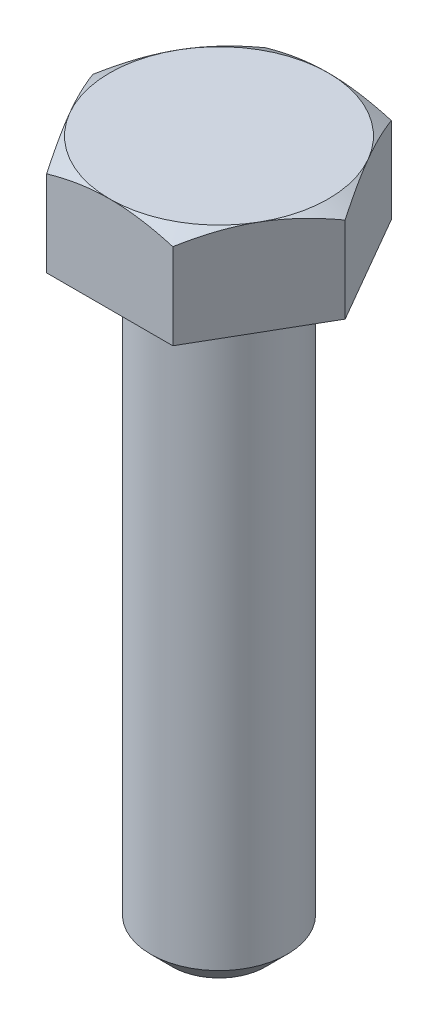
ISO-10303-21;
HEADER;
FILE_DESCRIPTION(('STEP AP214'),'2;1');
FILE_NAME('part.step','',(''),(''),'','','');
FILE_SCHEMA(('AUTOMOTIVE_DESIGN { 1 0 10303 214 1 1 1 1 }'));
ENDSEC;
DATA;
#1=APPLICATION_CONTEXT('core data for automotive mechanical design processes');
#2=APPLICATION_PROTOCOL_DEFINITION('international standard','automotive_design',2000,#1);
#3=PRODUCT_CONTEXT('',#1,'mechanical');
#4=PRODUCT('Part','Part','',(#3));
#5=PRODUCT_RELATED_PRODUCT_CATEGORY('part','',(#4));
#6=PRODUCT_DEFINITION_FORMATION('','',#4);
#7=PRODUCT_DEFINITION_CONTEXT('part definition',#1,'design');
#8=PRODUCT_DEFINITION('design','',#6,#7);
#9=PRODUCT_DEFINITION_SHAPE('','',#8);
#10=(LENGTH_UNIT() NAMED_UNIT(*) SI_UNIT(.MILLI.,.METRE.));
#11=(NAMED_UNIT(*) PLANE_ANGLE_UNIT() SI_UNIT($,.RADIAN.));
#12=(NAMED_UNIT(*) SI_UNIT($,.STERADIAN.) SOLID_ANGLE_UNIT());
#13=UNCERTAINTY_MEASURE_WITH_UNIT(LENGTH_MEASURE(1.E-05),#10,'distance_accuracy_value','');
#14=(GEOMETRIC_REPRESENTATION_CONTEXT(3) GLOBAL_UNCERTAINTY_ASSIGNED_CONTEXT((#13)) GLOBAL_UNIT_ASSIGNED_CONTEXT((#10,
#11,#12)) REPRESENTATION_CONTEXT('',''));
#15=CARTESIAN_POINT('',(0.,0.,0.));
#16=DIRECTION('',(0.,0.,1.));
#17=DIRECTION('',(1.,0.,0.));
#18=AXIS2_PLACEMENT_3D('',#15,#16,#17);
#19=CARTESIAN_POINT('',(0.,3.5,0.));
#20=DIRECTION('',(0.,-1.,0.));
#21=DIRECTION('',(1.,0.,0.));
#22=AXIS2_PLACEMENT_3D('',#19,#20,#21);
#23=PLANE('',#22);
#24=CARTESIAN_POINT('',(0.,3.50000000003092,0.));
#25=DIRECTION('',(0.,-1.,0.));
#26=DIRECTION('',(0.,0.,-1.));
#27=AXIS2_PLACEMENT_3D('',#24,#25,#26);
#28=CIRCLE('',#27,3.99999999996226);
#29=CARTESIAN_POINT('',(3.4641016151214,3.50000000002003,1.99999999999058));
#30=VERTEX_POINT('',#29);
#31=CARTESIAN_POINT('',(0.,3.50000000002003,3.99999999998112));
#32=VERTEX_POINT('',#31);
#33=EDGE_CURVE('E89',#30,#32,#28,.T.);
#34=ORIENTED_EDGE('',*,*,#33,.F.);
#35=CARTESIAN_POINT('',(0.,3.50000000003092,0.));
#36=DIRECTION('',(0.,-1.,0.));
#37=DIRECTION('',(0.,0.,-1.));
#38=AXIS2_PLACEMENT_3D('',#35,#36,#37);
#39=CIRCLE('',#38,3.99999999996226);
#40=CARTESIAN_POINT('',(3.4641016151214,3.50000000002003,-1.99999999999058));
#41=VERTEX_POINT('',#40);
#42=EDGE_CURVE('E87',#41,#30,#39,.T.);
#43=ORIENTED_EDGE('',*,*,#42,.F.);
#44=CARTESIAN_POINT('',(0.,3.50000000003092,0.));
#45=DIRECTION('',(0.,-1.,0.));
#46=DIRECTION('',(0.,0.,-1.));
#47=AXIS2_PLACEMENT_3D('',#44,#45,#46);
#48=CIRCLE('',#47,3.99999999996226);
#49=CARTESIAN_POINT('',(0.,3.50000000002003,-3.99999999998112));
#50=VERTEX_POINT('',#49);
#51=EDGE_CURVE('E20',#50,#41,#48,.T.);
#52=ORIENTED_EDGE('',*,*,#51,.F.);
#53=CARTESIAN_POINT('',(0.,3.50000000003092,0.));
#54=DIRECTION('',(0.,-1.,0.));
#55=DIRECTION('',(0.,0.,-1.));
#56=AXIS2_PLACEMENT_3D('',#53,#54,#55);
#57=CIRCLE('',#56,3.99999999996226);
#58=CARTESIAN_POINT('',(-3.4641016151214,3.50000000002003,-1.99999999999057));
#59=VERTEX_POINT('',#58);
#60=EDGE_CURVE('E104',#59,#50,#57,.T.);
#61=ORIENTED_EDGE('',*,*,#60,.F.);
#62=CARTESIAN_POINT('',(0.,3.50000000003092,0.));
#63=DIRECTION('',(0.,-1.,0.));
#64=DIRECTION('',(0.,0.,-1.));
#65=AXIS2_PLACEMENT_3D('',#62,#63,#64);
#66=CIRCLE('',#65,3.99999999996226);
#67=CARTESIAN_POINT('',(-3.4641016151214,3.50000000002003,1.99999999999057));
#68=VERTEX_POINT('',#67);
#69=EDGE_CURVE('E323',#68,#59,#66,.T.);
#70=ORIENTED_EDGE('',*,*,#69,.F.);
#71=CARTESIAN_POINT('',(0.,3.50000000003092,0.));
#72=DIRECTION('',(0.,-1.,0.));
#73=DIRECTION('',(0.,0.,-1.));
#74=AXIS2_PLACEMENT_3D('',#71,#72,#73);
#75=CIRCLE('',#74,3.99999999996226);
#76=EDGE_CURVE('E93',#32,#68,#75,.T.);
#77=ORIENTED_EDGE('',*,*,#76,.F.);
#78=EDGE_LOOP('',(#34,#43,#52,#61,#70,#77));
#79=FACE_BOUND('',#78,.T.);
#80=ADVANCED_FACE('F16',(#79),#23,.F.);
#81=CARTESIAN_POINT('',(0.,3.14059081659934,0.));
#82=DIRECTION('',(0.,-1.,0.));
#83=DIRECTION('',(0.,0.,-1.));
#84=AXIS2_PLACEMENT_3D('',#81,#82,#83);
#85=CONICAL_SURFACE('',#84,4.62251496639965,1.04719755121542);
#86=ORIENTED_EDGE('',*,*,#51,.T.);
#87=CARTESIAN_POINT('',(2.30940107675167,3.14273441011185,-4.00000000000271));
#88=CARTESIAN_POINT('',(2.4033932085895,3.19701440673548,-3.8372008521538));
#89=CARTESIAN_POINT('',(2.49813806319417,3.24674436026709,-3.67309795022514));
#90=CARTESIAN_POINT('',(2.68846293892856,3.33444223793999,-3.34344559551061));
#91=CARTESIAN_POINT('',(2.78403632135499,3.37246832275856,-3.17790764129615));
#92=CARTESIAN_POINT('',(2.92829837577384,3.41915789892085,-2.9280384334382));
#93=CARTESIAN_POINT('',(2.97656796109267,3.43300183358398,-2.84443305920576));
#94=CARTESIAN_POINT('',(3.07333821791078,3.45696597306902,-2.67682205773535));
#95=CARTESIAN_POINT('',(3.12183888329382,3.46708627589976,-2.59281644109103));
#96=CARTESIAN_POINT('',(3.21925069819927,3.48342533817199,-2.42409422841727));
#97=CARTESIAN_POINT('',(3.26816268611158,3.4896242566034,-2.33937618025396));
#98=CARTESIAN_POINT('',(3.36608285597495,3.49792016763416,-2.16977347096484));
#99=CARTESIAN_POINT('',(3.41509105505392,3.50001634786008,-2.08488878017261));
#100=CARTESIAN_POINT('',(3.46410161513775,3.50000000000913,-2.00000000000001));
#101=B_SPLINE_CURVE_WITH_KNOTS('',3,(#87,#88,#89,#90,#91,#92,#93,#94,#95,#96,#97,#98,#99,#100),
.UNSPECIFIED.,.F.,.F.,(4,2,2,2,2,2,4),(0.,0.587229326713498,1.17149154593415,1.4640059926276,
1.75651273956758,2.05048788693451,2.3445212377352),.UNSPECIFIED.);
#102=CARTESIAN_POINT('',(2.30940107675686,3.14273441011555,-4.00000000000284));
#103=VERTEX_POINT('',#102);
#104=EDGE_CURVE('E99',#103,#41,#101,.T.);
#105=ORIENTED_EDGE('',*,*,#104,.F.);
#106=CARTESIAN_POINT('',(0.,3.50000000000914,-3.99999999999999));
#107=CARTESIAN_POINT('',(0.0980211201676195,3.50001634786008,-3.99999999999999));
#108=CARTESIAN_POINT('',(0.196037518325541,3.49792016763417,-3.99999999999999));
#109=CARTESIAN_POINT('',(0.39187785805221,3.48962425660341,-3.99999999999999));
#110=CARTESIAN_POINT('',(0.489701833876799,3.48342533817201,-3.99999999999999));
#111=CARTESIAN_POINT('',(0.684525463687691,3.46708627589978,-3.99999999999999));
#112=CARTESIAN_POINT('',(0.781526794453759,3.45696597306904,-3.99999999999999));
#113=CARTESIAN_POINT('',(0.975067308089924,3.43300183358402,-3.99999999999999));
#114=CARTESIAN_POINT('',(1.07160647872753,3.41915789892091,-3.99999999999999));
#115=CARTESIAN_POINT('',(1.36013058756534,3.37246832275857,-3.99999999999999));
#116=CARTESIAN_POINT('',(1.55127735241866,3.33444223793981,-3.99999999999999));
#117=CARTESIAN_POINT('',(1.93192710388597,3.24674436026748,-3.99999999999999));
#118=CARTESIAN_POINT('',(2.12141681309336,3.19701440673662,-3.99999999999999));
#119=CARTESIAN_POINT('',(2.30940107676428,3.14273441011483,-3.99999999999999));
#120=B_SPLINE_CURVE_WITH_KNOTS('',3,(#106,#107,#108,#109,#110,#111,#112,#113,#114,#115,#116,
#117,#118,#119),.UNSPECIFIED.,.F.,.F.,(4,2,2,2,2,2,4),(0.,0.294033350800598,0.588008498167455,
0.880515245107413,1.17302969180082,1.75729191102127,2.34452123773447),.UNSPECIFIED.);
#121=EDGE_CURVE('E102',#50,#103,#120,.T.);
#122=ORIENTED_EDGE('',*,*,#121,.F.);
#123=EDGE_LOOP('',(#86,#105,#122));
#124=FACE_BOUND('',#123,.T.);
#125=ADVANCED_FACE('F97',(#124),#85,.T.);
#126=CARTESIAN_POINT('',(0.,3.14059081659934,0.));
#127=DIRECTION('',(0.,-1.,0.));
#128=DIRECTION('',(0.,0.,-1.));
#129=AXIS2_PLACEMENT_3D('',#126,#127,#128);
#130=CONICAL_SURFACE('',#129,4.62251496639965,1.04719755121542);
#131=ORIENTED_EDGE('',*,*,#60,.T.);
#132=CARTESIAN_POINT('',(-2.30940107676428,3.14273441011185,-3.99999999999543));
#133=CARTESIAN_POINT('',(-2.12141681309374,3.19701440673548,-3.9999999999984));
#134=CARTESIAN_POINT('',(-1.93192710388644,3.24674436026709,-3.99999999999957));
#135=CARTESIAN_POINT('',(-1.55127735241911,3.33444223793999,-4.0000000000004));
#136=CARTESIAN_POINT('',(-1.36013058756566,3.37246832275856,-4.00000000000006));
#137=CARTESIAN_POINT('',(-1.07160647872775,3.41915789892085,-3.99999999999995));
#138=CARTESIAN_POINT('',(-0.975067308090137,3.43300183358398,-3.99999999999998));
#139=CARTESIAN_POINT('',(-0.781526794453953,3.45696597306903,-4.));
#140=CARTESIAN_POINT('',(-0.684525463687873,3.46708627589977,-3.99999999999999));
#141=CARTESIAN_POINT('',(-0.489701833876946,3.483425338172,-3.99999999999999));
#142=CARTESIAN_POINT('',(-0.391877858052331,3.4896242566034,-3.99999999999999));
#143=CARTESIAN_POINT('',(-0.196037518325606,3.49792016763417,-3.99999999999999));
#144=CARTESIAN_POINT('',(-0.098021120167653,3.50001634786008,-3.99999999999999));
#145=CARTESIAN_POINT('',(0.,3.50000000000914,-3.99999999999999));
#146=B_SPLINE_CURVE_WITH_KNOTS('',3,(#132,#133,#134,#135,#136,#137,#138,#139,#140,#141,#142,
#143,#144,#145),.UNSPECIFIED.,.F.,.F.,(4,2,2,2,2,2,4),(0.,0.587229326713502,1.17149154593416,
1.46400599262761,1.75651273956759,2.05048788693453,2.34452123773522),.UNSPECIFIED.);
#147=CARTESIAN_POINT('',(-2.30940107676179,3.14273441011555,-3.99999999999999));
#148=VERTEX_POINT('',#147);
#149=EDGE_CURVE('E113',#148,#50,#146,.T.);
#150=ORIENTED_EDGE('',*,*,#149,.F.);
#151=CARTESIAN_POINT('',(-3.46410161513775,3.50000000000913,-2.00000000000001));
#152=CARTESIAN_POINT('',(-3.41509105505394,3.50001634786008,-2.08488878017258));
#153=CARTESIAN_POINT('',(-3.36608285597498,3.49792016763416,-2.16977347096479));
#154=CARTESIAN_POINT('',(-3.26816268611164,3.4896242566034,-2.33937618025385));
#155=CARTESIAN_POINT('',(-3.21925069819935,3.483425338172,-2.42409422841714));
#156=CARTESIAN_POINT('',(-3.1218388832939,3.46708627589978,-2.59281644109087));
#157=CARTESIAN_POINT('',(-3.07333821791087,3.45696597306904,-2.67682205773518));
#158=CARTESIAN_POINT('',(-2.97656796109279,3.43300183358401,-2.84443305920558));
#159=CARTESIAN_POINT('',(-2.92829837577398,3.41915789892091,-2.92803843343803));
#160=CARTESIAN_POINT('',(-2.78403632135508,3.37246832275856,-3.17790764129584));
#161=CARTESIAN_POINT('',(-2.68846293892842,3.33444223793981,-3.34344559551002));
#162=CARTESIAN_POINT('',(-2.49813806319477,3.24674436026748,-3.67309795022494));
#163=CARTESIAN_POINT('',(-2.40339320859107,3.19701440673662,-3.83720085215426));
#164=CARTESIAN_POINT('',(-2.30940107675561,3.14273441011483,-4.00000000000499));
#165=B_SPLINE_CURVE_WITH_KNOTS('',3,(#151,#152,#153,#154,#155,#156,#157,#158,#159,#160,#161,
#162,#163,#164),.UNSPECIFIED.,.F.,.F.,(4,2,2,2,2,2,4),(0.,0.294033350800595,0.58800849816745,
0.880515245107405,1.17302969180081,1.75729191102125,2.34452123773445),.UNSPECIFIED.);
#166=EDGE_CURVE('E169',#59,#148,#165,.T.);
#167=ORIENTED_EDGE('',*,*,#166,.F.);
#168=EDGE_LOOP('',(#131,#150,#167));
#169=FACE_BOUND('',#168,.T.);
#170=ADVANCED_FACE('F137',(#169),#130,.T.);
#171=CARTESIAN_POINT('',(0.,3.14059081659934,0.));
#172=DIRECTION('',(0.,-1.,0.));
#173=DIRECTION('',(0.,0.,-1.));
#174=AXIS2_PLACEMENT_3D('',#171,#172,#173);
#175=CONICAL_SURFACE('',#174,4.62251496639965,1.04719755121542);
#176=ORIENTED_EDGE('',*,*,#69,.T.);
#177=CARTESIAN_POINT('',(-4.61880215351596,3.14273441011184,7.2818296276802E-12));
#178=CARTESIAN_POINT('',(-4.52481002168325,3.19701440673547,-0.162799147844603));
#179=CARTESIAN_POINT('',(-4.43006516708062,3.24674436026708,-0.326902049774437));
#180=CARTESIAN_POINT('',(-4.23974029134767,3.33444223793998,-0.656554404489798));
#181=CARTESIAN_POINT('',(-4.14416690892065,3.37246832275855,-0.822092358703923));
#182=CARTESIAN_POINT('',(-3.9999048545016,3.41915789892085,-1.07196156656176));
#183=CARTESIAN_POINT('',(-3.95163526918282,3.43300183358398,-1.15556694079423));
#184=CARTESIAN_POINT('',(-3.85486501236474,3.45696597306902,-1.32317794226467));
#185=CARTESIAN_POINT('',(-3.80636434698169,3.46708627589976,-1.40718355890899));
#186=CARTESIAN_POINT('',(-3.70895253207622,3.48342533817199,-1.57590577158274));
#187=CARTESIAN_POINT('',(-3.66004054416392,3.4896242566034,-1.66062381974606));
#188=CARTESIAN_POINT('',(-3.56212037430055,3.49792016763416,-1.83022652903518));
#189=CARTESIAN_POINT('',(-3.51311217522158,3.50001634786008,-1.91511121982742));
#190=CARTESIAN_POINT('',(-3.46410161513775,3.50000000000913,-2.00000000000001));
#191=B_SPLINE_CURVE_WITH_KNOTS('',3,(#177,#178,#179,#180,#181,#182,#183,#184,#185,#186,#187,
#188,#189,#190),.UNSPECIFIED.,.F.,.F.,(4,2,2,2,2,2,4),(0.,0.587229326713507,1.17149154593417,
1.46400599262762,1.75651273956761,2.05048788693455,2.34452123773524),.UNSPECIFIED.);
#192=CARTESIAN_POINT('',(-4.61880215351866,3.14273441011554,2.84537209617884E-12));
#193=VERTEX_POINT('',#192);
#194=EDGE_CURVE('E146',#193,#59,#191,.T.);
#195=ORIENTED_EDGE('',*,*,#194,.F.);
#196=CARTESIAN_POINT('',(-3.46410161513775,3.50000000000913,2.00000000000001));
#197=CARTESIAN_POINT('',(-3.51311217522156,3.50001634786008,1.91511121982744));
#198=CARTESIAN_POINT('',(-3.56212037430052,3.49792016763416,1.83022652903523));
#199=CARTESIAN_POINT('',(-3.66004054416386,3.4896242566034,1.66062381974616));
#200=CARTESIAN_POINT('',(-3.70895253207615,3.483425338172,1.57590577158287));
#201=CARTESIAN_POINT('',(-3.8063643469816,3.46708627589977,1.40718355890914));
#202=CARTESIAN_POINT('',(-3.85486501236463,3.45696597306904,1.32317794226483));
#203=CARTESIAN_POINT('',(-3.95163526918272,3.43300183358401,1.15556694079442));
#204=CARTESIAN_POINT('',(-3.99990485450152,3.4191578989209,1.07196156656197));
#205=CARTESIAN_POINT('',(-4.14416690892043,3.37246832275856,0.822092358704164));
#206=CARTESIAN_POINT('',(-4.23974029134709,3.3344422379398,0.656554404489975));
#207=CARTESIAN_POINT('',(-4.43006516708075,3.24674436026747,0.326902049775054));
#208=CARTESIAN_POINT('',(-4.52481002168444,3.19701440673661,0.162799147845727));
#209=CARTESIAN_POINT('',(-4.6188021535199,3.14273441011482,-5.00231021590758E-12));
#210=B_SPLINE_CURVE_WITH_KNOTS('',3,(#196,#197,#198,#199,#200,#201,#202,#203,#204,#205,#206,
#207,#208,#209),.UNSPECIFIED.,.F.,.F.,(4,2,2,2,2,2,4),(0.,0.294033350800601,0.58800849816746,
0.880515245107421,1.17302969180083,1.75729191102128,2.34452123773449),.UNSPECIFIED.);
#211=EDGE_CURVE('E183',#68,#193,#210,.T.);
#212=ORIENTED_EDGE('',*,*,#211,.F.);
#213=EDGE_LOOP('',(#176,#195,#212));
#214=FACE_BOUND('',#213,.T.);
#215=ADVANCED_FACE('F191',(#214),#175,.T.);
#216=CARTESIAN_POINT('',(0.,3.14059081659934,0.));
#217=DIRECTION('',(0.,-1.,0.));
#218=DIRECTION('',(0.,0.,-1.));
#219=AXIS2_PLACEMENT_3D('',#216,#217,#218);
#220=CONICAL_SURFACE('',#219,4.62251496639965,1.04719755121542);
#221=ORIENTED_EDGE('',*,*,#76,.T.);
#222=CARTESIAN_POINT('',(-2.30940107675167,3.14273441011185,4.00000000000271));
#223=CARTESIAN_POINT('',(-2.40339320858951,3.19701440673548,3.8372008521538));
#224=CARTESIAN_POINT('',(-2.49813806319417,3.24674436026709,3.67309795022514));
#225=CARTESIAN_POINT('',(-2.68846293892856,3.33444223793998,3.34344559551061));
#226=CARTESIAN_POINT('',(-2.78403632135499,3.37246832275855,3.17790764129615));
#227=CARTESIAN_POINT('',(-2.92829837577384,3.41915789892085,2.9280384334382));
#228=CARTESIAN_POINT('',(-2.97656796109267,3.43300183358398,2.84443305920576));
#229=CARTESIAN_POINT('',(-3.07333821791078,3.45696597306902,2.67682205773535));
#230=CARTESIAN_POINT('',(-3.12183888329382,3.46708627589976,2.59281644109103));
#231=CARTESIAN_POINT('',(-3.21925069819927,3.48342533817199,2.42409422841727));
#232=CARTESIAN_POINT('',(-3.26816268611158,3.4896242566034,2.33937618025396));
#233=CARTESIAN_POINT('',(-3.36608285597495,3.49792016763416,2.16977347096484));
#234=CARTESIAN_POINT('',(-3.41509105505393,3.50001634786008,2.08488878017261));
#235=CARTESIAN_POINT('',(-3.46410161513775,3.50000000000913,2.00000000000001));
#236=B_SPLINE_CURVE_WITH_KNOTS('',3,(#222,#223,#224,#225,#226,#227,#228,#229,#230,#231,#232,
#233,#234,#235),.UNSPECIFIED.,.F.,.F.,(4,2,2,2,2,2,4),(0.,0.587229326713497,1.17149154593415,
1.4640059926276,1.75651273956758,2.05048788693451,2.3445212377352),.UNSPECIFIED.);
#237=CARTESIAN_POINT('',(-2.30940107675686,3.14273441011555,4.00000000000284));
#238=VERTEX_POINT('',#237);
#239=EDGE_CURVE('E176',#238,#68,#236,.T.);
#240=ORIENTED_EDGE('',*,*,#239,.F.);
#241=CARTESIAN_POINT('',(0.,3.50000000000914,3.99999999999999));
#242=CARTESIAN_POINT('',(-0.0980211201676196,3.50001634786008,3.99999999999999));
#243=CARTESIAN_POINT('',(-0.196037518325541,3.49792016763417,3.99999999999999));
#244=CARTESIAN_POINT('',(-0.39187785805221,3.48962425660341,3.99999999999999));
#245=CARTESIAN_POINT('',(-0.489701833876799,3.48342533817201,3.99999999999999));
#246=CARTESIAN_POINT('',(-0.684525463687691,3.46708627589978,3.99999999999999));
#247=CARTESIAN_POINT('',(-0.78152679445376,3.45696597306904,3.99999999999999));
#248=CARTESIAN_POINT('',(-0.975067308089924,3.43300183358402,3.99999999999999));
#249=CARTESIAN_POINT('',(-1.07160647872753,3.41915789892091,3.99999999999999));
#250=CARTESIAN_POINT('',(-1.36013058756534,3.37246832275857,3.99999999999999));
#251=CARTESIAN_POINT('',(-1.55127735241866,3.33444223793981,3.99999999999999));
#252=CARTESIAN_POINT('',(-1.93192710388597,3.24674436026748,3.99999999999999));
#253=CARTESIAN_POINT('',(-2.12141681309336,3.19701440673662,3.99999999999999));
#254=CARTESIAN_POINT('',(-2.30940107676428,3.14273441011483,3.99999999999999));
#255=B_SPLINE_CURVE_WITH_KNOTS('',3,(#241,#242,#243,#244,#245,#246,#247,#248,#249,#250,#251,
#252,#253,#254),.UNSPECIFIED.,.F.,.F.,(4,2,2,2,2,2,4),(0.,0.294033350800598,0.588008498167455,
0.880515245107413,1.17302969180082,1.75729191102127,2.34452123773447),.UNSPECIFIED.);
#256=EDGE_CURVE('E198',#32,#238,#255,.T.);
#257=ORIENTED_EDGE('',*,*,#256,.F.);
#258=EDGE_LOOP('',(#221,#240,#257));
#259=FACE_BOUND('',#258,.T.);
#260=ADVANCED_FACE('F188',(#259),#220,.T.);
#261=CARTESIAN_POINT('',(0.,3.14059081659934,0.));
#262=DIRECTION('',(0.,-1.,0.));
#263=DIRECTION('',(0.,0.,-1.));
#264=AXIS2_PLACEMENT_3D('',#261,#262,#263);
#265=CONICAL_SURFACE('',#264,4.62251496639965,1.04719755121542);
#266=ORIENTED_EDGE('',*,*,#42,.T.);
#267=CARTESIAN_POINT('',(4.61880215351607,3.1427344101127,-5.88236889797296E-12));
#268=CARTESIAN_POINT('',(4.52481002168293,3.19701440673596,0.16279914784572));
#269=CARTESIAN_POINT('',(4.43006516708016,3.24674436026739,0.326902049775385));
#270=CARTESIAN_POINT('',(4.23974029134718,3.33444223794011,0.656554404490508));
#271=CARTESIAN_POINT('',(4.14416690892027,3.37246832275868,0.822092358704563));
#272=CARTESIAN_POINT('',(3.99990485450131,3.41915789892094,1.07196156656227));
#273=CARTESIAN_POINT('',(3.95163526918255,3.43300183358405,1.1555669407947));
#274=CARTESIAN_POINT('',(3.85486501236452,3.45696597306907,1.32317794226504));
#275=CARTESIAN_POINT('',(3.8063643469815,3.4670862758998,1.40718355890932));
#276=CARTESIAN_POINT('',(3.70895253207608,3.48342533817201,1.57590577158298));
#277=CARTESIAN_POINT('',(3.6600405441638,3.48962425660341,1.66062381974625));
#278=CARTESIAN_POINT('',(3.5621203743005,3.49792016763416,1.83022652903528));
#279=CARTESIAN_POINT('',(3.51311217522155,3.50001634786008,1.91511121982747));
#280=CARTESIAN_POINT('',(3.46410161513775,3.50000000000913,2.00000000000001));
#281=B_SPLINE_CURVE_WITH_KNOTS('',3,(#267,#268,#269,#270,#271,#272,#273,#274,#275,#276,#277,
#278,#279,#280),.UNSPECIFIED.,.F.,.F.,(4,2,2,2,2,2,4),(0.,0.587229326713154,1.17149154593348,
1.46400599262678,1.75651273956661,2.05048788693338,2.34452123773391),.UNSPECIFIED.);
#282=CARTESIAN_POINT('',(4.61880215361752,3.14273441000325,2.28554564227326E-12));
#283=VERTEX_POINT('',#282);
#284=EDGE_CURVE('E109',#283,#30,#281,.T.);
#285=ORIENTED_EDGE('',*,*,#284,.F.);
#286=CARTESIAN_POINT('',(3.46410161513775,3.50000000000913,-2.00000000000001));
#287=CARTESIAN_POINT('',(3.51311217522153,3.50001634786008,-1.91511121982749));
#288=CARTESIAN_POINT('',(3.56212037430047,3.49792016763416,-1.83022652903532));
#289=CARTESIAN_POINT('',(3.66004054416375,3.48962425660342,-1.66062381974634));
#290=CARTESIAN_POINT('',(3.70895253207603,3.48342533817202,-1.57590577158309));
#291=CARTESIAN_POINT('',(3.80636434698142,3.46708627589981,-1.40718355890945));
#292=CARTESIAN_POINT('',(3.85486501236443,3.45696597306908,-1.32317794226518));
#293=CARTESIAN_POINT('',(3.95163526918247,3.43300183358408,-1.15556694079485));
#294=CARTESIAN_POINT('',(3.99990485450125,3.41915789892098,-1.07196156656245));
#295=CARTESIAN_POINT('',(4.14416690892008,3.37246832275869,-0.82209235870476));
#296=CARTESIAN_POINT('',(4.2397402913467,3.33444223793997,-0.656554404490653));
#297=CARTESIAN_POINT('',(4.43006516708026,3.24674436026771,-0.326902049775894));
#298=CARTESIAN_POINT('',(4.52481002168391,3.1970144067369,-0.162799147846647));
#299=CARTESIAN_POINT('',(4.61880215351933,3.14273441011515,4.0037334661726E-12));
#300=B_SPLINE_CURVE_WITH_KNOTS('',3,(#286,#287,#288,#289,#290,#291,#292,#293,#294,#295,#296,
#297,#298,#299),.UNSPECIFIED.,.F.,.F.,(4,2,2,2,2,2,4),(0.,0.294033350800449,0.588008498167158,
0.880515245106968,1.17302969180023,1.75729191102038,2.34452123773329),.UNSPECIFIED.);
#301=EDGE_CURVE('E106',#41,#283,#300,.T.);
#302=ORIENTED_EDGE('',*,*,#301,.F.);
#303=EDGE_LOOP('',(#266,#285,#302));
#304=FACE_BOUND('',#303,.T.);
#305=ADVANCED_FACE('F107',(#304),#265,.T.);
#306=CARTESIAN_POINT('',(0.,3.14059081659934,0.));
#307=DIRECTION('',(0.,-1.,0.));
#308=DIRECTION('',(0.,0.,-1.));
#309=AXIS2_PLACEMENT_3D('',#306,#307,#308);
#310=CONICAL_SURFACE('',#309,4.62251496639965,1.04719755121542);
#311=ORIENTED_EDGE('',*,*,#33,.T.);
#312=CARTESIAN_POINT('',(2.30940107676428,3.14273441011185,3.99999999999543));
#313=CARTESIAN_POINT('',(2.12141681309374,3.19701440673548,3.9999999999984));
#314=CARTESIAN_POINT('',(1.93192710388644,3.24674436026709,3.99999999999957));
#315=CARTESIAN_POINT('',(1.5512773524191,3.33444223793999,4.0000000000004));
#316=CARTESIAN_POINT('',(1.36013058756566,3.37246832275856,4.00000000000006));
#317=CARTESIAN_POINT('',(1.07160647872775,3.41915789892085,3.99999999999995));
#318=CARTESIAN_POINT('',(0.975067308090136,3.43300183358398,3.99999999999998));
#319=CARTESIAN_POINT('',(0.781526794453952,3.45696597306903,4.));
#320=CARTESIAN_POINT('',(0.684525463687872,3.46708627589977,3.99999999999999));
#321=CARTESIAN_POINT('',(0.489701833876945,3.483425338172,3.99999999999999));
#322=CARTESIAN_POINT('',(0.39187785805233,3.4896242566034,3.99999999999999));
#323=CARTESIAN_POINT('',(0.196037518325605,3.49792016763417,3.99999999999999));
#324=CARTESIAN_POINT('',(0.0980211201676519,3.50001634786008,3.99999999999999));
#325=CARTESIAN_POINT('',(0.,3.50000000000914,3.99999999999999));
#326=B_SPLINE_CURVE_WITH_KNOTS('',3,(#312,#313,#314,#315,#316,#317,#318,#319,#320,#321,#322,
#323,#324,#325),.UNSPECIFIED.,.F.,.F.,(4,2,2,2,2,2,4),(0.,0.587229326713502,1.17149154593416,
1.46400599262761,1.7565127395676,2.05048788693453,2.34452123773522),.UNSPECIFIED.);
#327=CARTESIAN_POINT('',(2.30940107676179,3.14273441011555,3.99999999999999));
#328=VERTEX_POINT('',#327);
#329=EDGE_CURVE('E205',#328,#32,#326,.T.);
#330=ORIENTED_EDGE('',*,*,#329,.F.);
#331=CARTESIAN_POINT('',(3.46410161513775,3.50000000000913,2.00000000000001));
#332=CARTESIAN_POINT('',(3.41509105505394,3.50001634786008,2.08488878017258));
#333=CARTESIAN_POINT('',(3.36608285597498,3.49792016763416,2.16977347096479));
#334=CARTESIAN_POINT('',(3.26816268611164,3.4896242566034,2.33937618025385));
#335=CARTESIAN_POINT('',(3.21925069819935,3.483425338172,2.42409422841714));
#336=CARTESIAN_POINT('',(3.1218388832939,3.46708627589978,2.59281644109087));
#337=CARTESIAN_POINT('',(3.07333821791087,3.45696597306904,2.67682205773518));
#338=CARTESIAN_POINT('',(2.97656796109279,3.43300183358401,2.84443305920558));
#339=CARTESIAN_POINT('',(2.92829837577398,3.41915789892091,2.92803843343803));
#340=CARTESIAN_POINT('',(2.78403632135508,3.37246832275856,3.17790764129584));
#341=CARTESIAN_POINT('',(2.68846293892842,3.33444223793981,3.34344559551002));
#342=CARTESIAN_POINT('',(2.49813806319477,3.24674436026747,3.67309795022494));
#343=CARTESIAN_POINT('',(2.40339320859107,3.19701440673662,3.83720085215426));
#344=CARTESIAN_POINT('',(2.30940107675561,3.14273441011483,4.00000000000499));
#345=B_SPLINE_CURVE_WITH_KNOTS('',3,(#331,#332,#333,#334,#335,#336,#337,#338,#339,#340,#341,
#342,#343,#344),.UNSPECIFIED.,.F.,.F.,(4,2,2,2,2,2,4),(0.,0.294033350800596,0.58800849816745,
0.880515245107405,1.17302969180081,1.75729191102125,2.34452123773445),.UNSPECIFIED.);
#346=EDGE_CURVE('E225',#30,#328,#345,.T.);
#347=ORIENTED_EDGE('',*,*,#346,.F.);
#348=EDGE_LOOP('',(#311,#330,#347));
#349=FACE_BOUND('',#348,.T.);
#350=ADVANCED_FACE('F233',(#349),#310,.T.);
#351=CARTESIAN_POINT('',(0.,-22.,0.));
#352=DIRECTION('',(0.,1.,0.));
#353=DIRECTION('',(0.,0.,1.));
#354=AXIS2_PLACEMENT_3D('',#351,#352,#353);
#355=PLANE('',#354);
#356=CARTESIAN_POINT('',(0.,-21.9999999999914,0.));
#357=DIRECTION('',(0.,1.,0.));
#358=DIRECTION('',(0.,0.,1.));
#359=AXIS2_PLACEMENT_3D('',#356,#357,#358);
#360=CIRCLE('',#359,1.70000000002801);
#361=CARTESIAN_POINT('',(0.,-21.9999999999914,1.70000000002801));
#362=VERTEX_POINT('',#361);
#363=EDGE_CURVE('E232',#362,#362,#360,.T.);
#364=ORIENTED_EDGE('',*,*,#363,.F.);
#365=EDGE_LOOP('',(#364));
#366=FACE_BOUND('',#365,.T.);
#367=ADVANCED_FACE('F236',(#366),#355,.F.);
#368=CARTESIAN_POINT('',(2.3094010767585,19.66,-3.99999999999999));
#369=DIRECTION('',(0.866025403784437,0.,-0.500000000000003));
#370=DIRECTION('',(-0.500000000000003,0.,-0.866025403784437));
#371=AXIS2_PLACEMENT_3D('',#368,#369,#370);
#372=PLANE('',#371);
#373=DIRECTION('',(-0.500000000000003,0.,-0.866025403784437));
#374=VECTOR('',#373,1.);
#375=CARTESIAN_POINT('',(4.61880215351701,0.,0.));
#376=LINE('',#375,#374);
#377=CARTESIAN_POINT('',(4.61880215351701,0.,0.));
#378=VERTEX_POINT('',#377);
#379=CARTESIAN_POINT('',(2.3094010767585,0.,-3.99999999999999));
#380=VERTEX_POINT('',#379);
#381=EDGE_CURVE('E268',#378,#380,#376,.T.);
#382=ORIENTED_EDGE('',*,*,#381,.T.);
#383=DIRECTION('',(0.,1.,0.));
#384=VECTOR('',#383,1.);
#385=CARTESIAN_POINT('',(2.3094010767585,19.66,-3.99999999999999));
#386=LINE('',#385,#384);
#387=EDGE_CURVE('E117',#103,#380,#386,.F.);
#388=ORIENTED_EDGE('',*,*,#387,.F.);
#389=ORIENTED_EDGE('',*,*,#104,.T.);
#390=ORIENTED_EDGE('',*,*,#301,.T.);
#391=DIRECTION('',(0.,1.,0.));
#392=VECTOR('',#391,1.);
#393=CARTESIAN_POINT('',(4.61880215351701,19.66,0.));
#394=LINE('',#393,#392);
#395=EDGE_CURVE('E312',#378,#283,#394,.T.);
#396=ORIENTED_EDGE('',*,*,#395,.F.);
#397=EDGE_LOOP('',(#382,#388,#389,#390,#396));
#398=FACE_BOUND('',#397,.T.);
#399=ADVANCED_FACE('F115',(#398),#372,.T.);
#400=CARTESIAN_POINT('',(-2.3094010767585,19.66,-3.99999999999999));
#401=DIRECTION('',(0.,0.,-1.));
#402=DIRECTION('',(-1.,0.,0.));
#403=AXIS2_PLACEMENT_3D('',#400,#401,#402);
#404=PLANE('',#403);
#405=DIRECTION('',(-1.,0.,0.));
#406=VECTOR('',#405,1.);
#407=CARTESIAN_POINT('',(0.,0.,-3.99999999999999));
#408=LINE('',#407,#406);
#409=CARTESIAN_POINT('',(-2.3094010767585,0.,-3.99999999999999));
#410=VERTEX_POINT('',#409);
#411=EDGE_CURVE('E270',#380,#410,#408,.T.);
#412=ORIENTED_EDGE('',*,*,#411,.T.);
#413=DIRECTION('',(0.,1.,0.));
#414=VECTOR('',#413,1.);
#415=CARTESIAN_POINT('',(-2.3094010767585,19.66,-3.99999999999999));
#416=LINE('',#415,#414);
#417=EDGE_CURVE('E175',#148,#410,#416,.F.);
#418=ORIENTED_EDGE('',*,*,#417,.F.);
#419=ORIENTED_EDGE('',*,*,#149,.T.);
#420=ORIENTED_EDGE('',*,*,#121,.T.);
#421=ORIENTED_EDGE('',*,*,#387,.T.);
#422=EDGE_LOOP('',(#412,#418,#419,#420,#421));
#423=FACE_BOUND('',#422,.T.);
#424=ADVANCED_FACE('F155',(#423),#404,.T.);
#425=CARTESIAN_POINT('',(-2.3094010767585,19.66,-3.99999999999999));
#426=DIRECTION('',(-0.866025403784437,0.,-0.500000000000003));
#427=DIRECTION('',(-0.500000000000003,0.,0.866025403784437));
#428=AXIS2_PLACEMENT_3D('',#425,#426,#427);
#429=PLANE('',#428);
#430=DIRECTION('',(-0.500000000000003,0.,0.866025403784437));
#431=VECTOR('',#430,1.);
#432=CARTESIAN_POINT('',(-2.3094010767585,0.,-3.99999999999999));
#433=LINE('',#432,#431);
#434=CARTESIAN_POINT('',(-4.61880215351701,0.,0.));
#435=VERTEX_POINT('',#434);
#436=EDGE_CURVE('E278',#410,#435,#433,.T.);
#437=ORIENTED_EDGE('',*,*,#436,.T.);
#438=DIRECTION('',(0.,1.,0.));
#439=VECTOR('',#438,1.);
#440=CARTESIAN_POINT('',(-4.61880215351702,19.66,0.));
#441=LINE('',#440,#439);
#442=EDGE_CURVE('E302',#193,#435,#441,.F.);
#443=ORIENTED_EDGE('',*,*,#442,.F.);
#444=ORIENTED_EDGE('',*,*,#194,.T.);
#445=ORIENTED_EDGE('',*,*,#166,.T.);
#446=ORIENTED_EDGE('',*,*,#417,.T.);
#447=EDGE_LOOP('',(#437,#443,#444,#445,#446));
#448=FACE_BOUND('',#447,.T.);
#449=ADVANCED_FACE('F158',(#448),#429,.T.);
#450=CARTESIAN_POINT('',(-2.3094010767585,19.66,3.99999999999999));
#451=DIRECTION('',(-0.866025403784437,0.,0.500000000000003));
#452=DIRECTION('',(0.500000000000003,0.,0.866025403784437));
#453=AXIS2_PLACEMENT_3D('',#450,#451,#452);
#454=PLANE('',#453);
#455=DIRECTION('',(0.500000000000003,0.,0.866025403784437));
#456=VECTOR('',#455,1.);
#457=CARTESIAN_POINT('',(-4.61880215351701,0.,0.));
#458=LINE('',#457,#456);
#459=CARTESIAN_POINT('',(-2.3094010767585,0.,3.99999999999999));
#460=VERTEX_POINT('',#459);
#461=EDGE_CURVE('E274',#435,#460,#458,.T.);
#462=ORIENTED_EDGE('',*,*,#461,.T.);
#463=DIRECTION('',(0.,1.,0.));
#464=VECTOR('',#463,1.);
#465=CARTESIAN_POINT('',(-2.3094010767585,19.66,3.99999999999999));
#466=LINE('',#465,#464);
#467=EDGE_CURVE('E204',#238,#460,#466,.F.);
#468=ORIENTED_EDGE('',*,*,#467,.F.);
#469=ORIENTED_EDGE('',*,*,#239,.T.);
#470=ORIENTED_EDGE('',*,*,#211,.T.);
#471=ORIENTED_EDGE('',*,*,#442,.T.);
#472=EDGE_LOOP('',(#462,#468,#469,#470,#471));
#473=FACE_BOUND('',#472,.T.);
#474=ADVANCED_FACE('F164',(#473),#454,.T.);
#475=CARTESIAN_POINT('',(-2.3094010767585,19.66,3.99999999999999));
#476=DIRECTION('',(0.,0.,1.));
#477=DIRECTION('',(1.,0.,0.));
#478=AXIS2_PLACEMENT_3D('',#475,#476,#477);
#479=PLANE('',#478);
#480=DIRECTION('',(-1.,0.,0.));
#481=VECTOR('',#480,1.);
#482=CARTESIAN_POINT('',(0.,0.,3.99999999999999));
#483=LINE('',#482,#481);
#484=CARTESIAN_POINT('',(2.3094010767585,0.,3.99999999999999));
#485=VERTEX_POINT('',#484);
#486=EDGE_CURVE('E35',#460,#485,#483,.F.);
#487=ORIENTED_EDGE('',*,*,#486,.T.);
#488=DIRECTION('',(0.,1.,0.));
#489=VECTOR('',#488,1.);
#490=CARTESIAN_POINT('',(2.3094010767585,19.66,3.99999999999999));
#491=LINE('',#490,#489);
#492=EDGE_CURVE('E231',#328,#485,#491,.F.);
#493=ORIENTED_EDGE('',*,*,#492,.F.);
#494=ORIENTED_EDGE('',*,*,#329,.T.);
#495=ORIENTED_EDGE('',*,*,#256,.T.);
#496=ORIENTED_EDGE('',*,*,#467,.T.);
#497=EDGE_LOOP('',(#487,#493,#494,#495,#496));
#498=FACE_BOUND('',#497,.T.);
#499=ADVANCED_FACE('F214',(#498),#479,.T.);
#500=CARTESIAN_POINT('',(2.3094010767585,19.66,3.99999999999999));
#501=DIRECTION('',(0.866025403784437,0.,0.500000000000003));
#502=DIRECTION('',(0.500000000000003,0.,-0.866025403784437));
#503=AXIS2_PLACEMENT_3D('',#500,#501,#502);
#504=PLANE('',#503);
#505=DIRECTION('',(0.500000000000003,0.,-0.866025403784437));
#506=VECTOR('',#505,1.);
#507=CARTESIAN_POINT('',(2.3094010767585,0.,3.99999999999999));
#508=LINE('',#507,#506);
#509=EDGE_CURVE('E258',#485,#378,#508,.T.);
#510=ORIENTED_EDGE('',*,*,#509,.T.);
#511=ORIENTED_EDGE('',*,*,#395,.T.);
#512=ORIENTED_EDGE('',*,*,#284,.T.);
#513=ORIENTED_EDGE('',*,*,#346,.T.);
#514=ORIENTED_EDGE('',*,*,#492,.T.);
#515=EDGE_LOOP('',(#510,#511,#512,#513,#514));
#516=FACE_BOUND('',#515,.T.);
#517=ADVANCED_FACE('F217',(#516),#504,.T.);
#518=CARTESIAN_POINT('',(0.,-21.2000000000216,0.));
#519=DIRECTION('',(0.,1.,0.));
#520=DIRECTION('',(0.,0.,1.));
#521=AXIS2_PLACEMENT_3D('',#518,#519,#520);
#522=CONICAL_SURFACE('',#521,2.49999999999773,0.785398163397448);
#523=CARTESIAN_POINT('',(0.,-21.2,0.));
#524=DIRECTION('',(0.,1.,0.));
#525=DIRECTION('',(0.,0.,1.));
#526=AXIS2_PLACEMENT_3D('',#523,#524,#525);
#527=CIRCLE('',#526,2.5);
#528=CARTESIAN_POINT('',(0.,-21.2,2.5));
#529=VERTEX_POINT('',#528);
#530=EDGE_CURVE('E26',#529,#529,#527,.T.);
#531=ORIENTED_EDGE('',*,*,#530,.F.);
#532=EDGE_LOOP('',(#531));
#533=FACE_BOUND('',#532,.T.);
#534=ORIENTED_EDGE('',*,*,#363,.T.);
#535=EDGE_LOOP('',(#534));
#536=FACE_BOUND('',#535,.T.);
#537=ADVANCED_FACE('F222',(#533,#536),#522,.T.);
#538=CARTESIAN_POINT('',(0.,0.,0.));
#539=DIRECTION('',(0.,1.,0.));
#540=DIRECTION('',(-1.,0.,0.));
#541=AXIS2_PLACEMENT_3D('',#538,#539,#540);
#542=PLANE('',#541);
#543=ORIENTED_EDGE('',*,*,#486,.F.);
#544=ORIENTED_EDGE('',*,*,#461,.F.);
#545=ORIENTED_EDGE('',*,*,#436,.F.);
#546=ORIENTED_EDGE('',*,*,#411,.F.);
#547=ORIENTED_EDGE('',*,*,#381,.F.);
#548=ORIENTED_EDGE('',*,*,#509,.F.);
#549=EDGE_LOOP('',(#543,#544,#545,#546,#547,#548));
#550=FACE_BOUND('',#549,.T.);
#551=CARTESIAN_POINT('',(0.,0.,0.));
#552=DIRECTION('',(0.,1.,0.));
#553=DIRECTION('',(0.,0.,1.));
#554=AXIS2_PLACEMENT_3D('',#551,#552,#553);
#555=CIRCLE('',#554,2.5);
#556=CARTESIAN_POINT('',(0.,0.,2.5));
#557=VERTEX_POINT('',#556);
#558=EDGE_CURVE('E10',#557,#557,#555,.F.);
#559=ORIENTED_EDGE('',*,*,#558,.F.);
#560=EDGE_LOOP('',(#559));
#561=FACE_BOUND('',#560,.T.);
#562=ADVANCED_FACE('F247',(#550,#561),#542,.F.);
#563=CARTESIAN_POINT('',(0.,-22.,0.));
#564=DIRECTION('',(0.,1.,0.));
#565=DIRECTION('',(0.,0.,1.));
#566=AXIS2_PLACEMENT_3D('',#563,#564,#565);
#567=CYLINDRICAL_SURFACE('',#566,2.5);
#568=ORIENTED_EDGE('',*,*,#558,.T.);
#569=EDGE_LOOP('',(#568));
#570=FACE_BOUND('',#569,.T.);
#571=ORIENTED_EDGE('',*,*,#530,.T.);
#572=EDGE_LOOP('',(#571));
#573=FACE_BOUND('',#572,.T.);
#574=ADVANCED_FACE('F18',(#570,#573),#567,.T.);
#575=CLOSED_SHELL('',(#80,#125,#170,#215,#260,#305,#350,#367,#399,#424,#449,#474,#499,#517,#537,
#562,#574));
#576=MANIFOLD_SOLID_BREP('B1',#575);
#577=ADVANCED_BREP_SHAPE_REPRESENTATION('',(#18,#576),#14);
#578=SHAPE_DEFINITION_REPRESENTATION(#9,#577);
ENDSEC;
END-ISO-10303-21;
